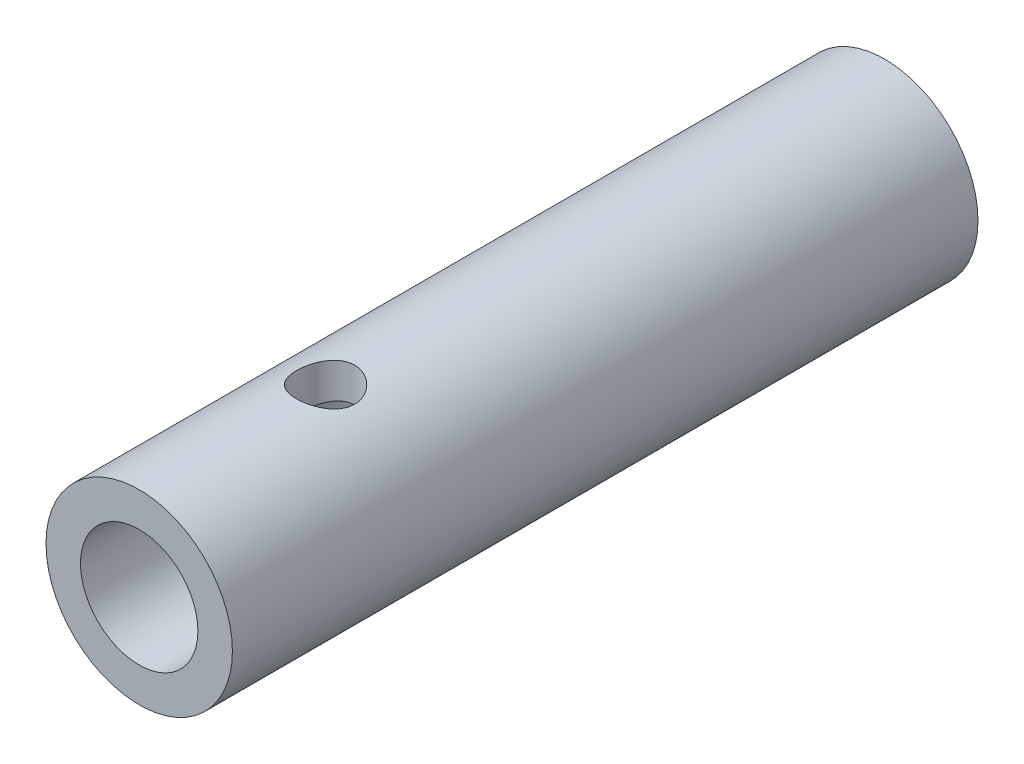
ISO-10303-21;
HEADER;
FILE_DESCRIPTION(('STEP AP214'),'2;1');
FILE_NAME('part.step','',(''),(''),'','','');
FILE_SCHEMA(('AUTOMOTIVE_DESIGN { 1 0 10303 214 1 1 1 1 }'));
ENDSEC;
DATA;
#1=APPLICATION_CONTEXT('core data for automotive mechanical design processes');
#2=APPLICATION_PROTOCOL_DEFINITION('international standard','automotive_design',2000,#1);
#3=PRODUCT_CONTEXT('',#1,'mechanical');
#4=PRODUCT('Part','Part','',(#3));
#5=PRODUCT_RELATED_PRODUCT_CATEGORY('part','',(#4));
#6=PRODUCT_DEFINITION_FORMATION('','',#4);
#7=PRODUCT_DEFINITION_CONTEXT('part definition',#1,'design');
#8=PRODUCT_DEFINITION('design','',#6,#7);
#9=PRODUCT_DEFINITION_SHAPE('','',#8);
#10=(LENGTH_UNIT() NAMED_UNIT(*) SI_UNIT(.MILLI.,.METRE.));
#11=(NAMED_UNIT(*) PLANE_ANGLE_UNIT() SI_UNIT($,.RADIAN.));
#12=(NAMED_UNIT(*) SI_UNIT($,.STERADIAN.) SOLID_ANGLE_UNIT());
#13=UNCERTAINTY_MEASURE_WITH_UNIT(LENGTH_MEASURE(1.E-05),#10,'distance_accuracy_value','');
#14=(GEOMETRIC_REPRESENTATION_CONTEXT(3) GLOBAL_UNCERTAINTY_ASSIGNED_CONTEXT((#13)) GLOBAL_UNIT_ASSIGNED_CONTEXT((#10,
#11,#12)) REPRESENTATION_CONTEXT('',''));
#15=CARTESIAN_POINT('',(0.,0.,0.));
#16=DIRECTION('',(0.,0.,1.));
#17=DIRECTION('',(1.,0.,0.));
#18=AXIS2_PLACEMENT_3D('',#15,#16,#17);
#19=CARTESIAN_POINT('',(0.,0.,12.7));
#20=DIRECTION('',(0.,0.,-1.));
#21=DIRECTION('',(-1.,0.,0.));
#22=AXIS2_PLACEMENT_3D('',#19,#20,#21);
#23=CYLINDRICAL_SURFACE('',#22,3.175);
#24=CARTESIAN_POINT('',(0.,0.,12.7));
#25=DIRECTION('',(0.,0.,1.));
#26=DIRECTION('',(1.,0.,0.));
#27=AXIS2_PLACEMENT_3D('',#24,#25,#26);
#28=CIRCLE('',#27,3.175);
#29=CARTESIAN_POINT('',(3.175,0.,12.7));
#30=VERTEX_POINT('',#29);
#31=EDGE_CURVE('E10',#30,#30,#28,.T.);
#32=ORIENTED_EDGE('',*,*,#31,.F.);
#33=EDGE_LOOP('',(#32));
#34=FACE_BOUND('',#33,.T.);
#35=CARTESIAN_POINT('',(0.,0.,-12.7));
#36=DIRECTION('',(0.,0.,1.));
#37=DIRECTION('',(1.,0.,0.));
#38=AXIS2_PLACEMENT_3D('',#35,#36,#37);
#39=CIRCLE('',#38,3.175);
#40=CARTESIAN_POINT('',(3.175,0.,-12.7));
#41=VERTEX_POINT('',#40);
#42=EDGE_CURVE('E44',#41,#41,#39,.T.);
#43=ORIENTED_EDGE('',*,*,#42,.T.);
#44=EDGE_LOOP('',(#43));
#45=FACE_BOUND('',#44,.T.);
#46=CARTESIAN_POINT('',(0.,3.175,5.3578125));
#47=CARTESIAN_POINT('',(-0.0543236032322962,3.17499972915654,5.35781285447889));
#48=CARTESIAN_POINT('',(-0.108650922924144,3.17359264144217,5.36228863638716));
#49=CARTESIAN_POINT('',(-0.215716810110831,3.1681173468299,5.38002657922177));
#50=CARTESIAN_POINT('',(-0.268455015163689,3.16404853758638,5.39329072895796));
#51=CARTESIAN_POINT('',(-0.370783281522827,3.15369428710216,5.42811443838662));
#52=CARTESIAN_POINT('',(-0.420378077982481,3.14741227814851,5.44966115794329));
#53=CARTESIAN_POINT('',(-0.515250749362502,3.13328025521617,5.50038374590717));
#54=CARTESIAN_POINT('',(-0.560527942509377,3.1254299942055,5.52956081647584));
#55=CARTESIAN_POINT('',(-0.646878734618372,3.10872357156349,5.59566444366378));
#56=CARTESIAN_POINT('',(-0.687800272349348,3.09984549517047,5.63278407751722));
#57=CARTESIAN_POINT('',(-0.762950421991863,3.08221099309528,5.71330803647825));
#58=CARTESIAN_POINT('',(-0.79717778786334,3.07345459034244,5.7567135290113));
#59=CARTESIAN_POINT('',(-0.858792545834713,3.05681971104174,5.84989349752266));
#60=CARTESIAN_POINT('',(-0.885989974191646,3.0489682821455,5.89979887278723));
#61=CARTESIAN_POINT('',(-0.93154294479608,3.03536192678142,6.00376015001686));
#62=CARTESIAN_POINT('',(-0.94990081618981,3.02960644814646,6.05781495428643));
#63=CARTESIAN_POINT('',(-0.97669715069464,3.02107288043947,6.16682478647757));
#64=CARTESIAN_POINT('',(-0.985417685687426,3.01821034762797,6.22170368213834));
#65=CARTESIAN_POINT('',(-0.993573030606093,3.01553606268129,6.33221453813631));
#66=CARTESIAN_POINT('',(-0.99301030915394,3.01572349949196,6.38784629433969));
#67=CARTESIAN_POINT('',(-0.982835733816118,3.01905343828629,6.49595035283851));
#68=CARTESIAN_POINT('',(-0.973582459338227,3.02207883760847,6.54846061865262));
#69=CARTESIAN_POINT('',(-0.946870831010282,3.03055357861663,6.65114252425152));
#70=CARTESIAN_POINT('',(-0.92941160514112,3.03600317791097,6.70131391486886));
#71=CARTESIAN_POINT('',(-0.886530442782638,3.04880203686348,6.7987481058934));
#72=CARTESIAN_POINT('',(-0.860995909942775,3.05617788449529,6.84595770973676));
#73=CARTESIAN_POINT('',(-0.80276716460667,3.0719859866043,6.93553966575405));
#74=CARTESIAN_POINT('',(-0.77007109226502,3.08041851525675,6.97791075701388));
#75=CARTESIAN_POINT('',(-0.696687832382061,3.09785962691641,7.05864011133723));
#76=CARTESIAN_POINT('',(-0.655704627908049,3.10687695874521,7.09672789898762));
#77=CARTESIAN_POINT('',(-0.567820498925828,3.12413309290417,7.16555581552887));
#78=CARTESIAN_POINT('',(-0.520919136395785,3.13237183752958,7.19629540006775));
#79=CARTESIAN_POINT('',(-0.422008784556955,3.14722902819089,7.24973760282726));
#80=CARTESIAN_POINT('',(-0.369962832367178,3.15383434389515,7.27237570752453));
#81=CARTESIAN_POINT('',(-0.262547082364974,3.16458564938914,7.30849519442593));
#82=CARTESIAN_POINT('',(-0.207178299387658,3.16873238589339,7.32197935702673));
#83=CARTESIAN_POINT('',(-0.0969844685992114,3.17397915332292,7.33894744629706));
#84=CARTESIAN_POINT('',(-0.0422210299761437,3.17519068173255,7.34279753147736));
#85=CARTESIAN_POINT('',(0.067175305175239,3.17476028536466,7.34142055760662));
#86=CARTESIAN_POINT('',(0.121808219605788,3.17311877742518,7.33619482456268));
#87=CARTESIAN_POINT('',(0.227980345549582,3.16724001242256,7.31710849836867));
#88=CARTESIAN_POINT('',(0.279562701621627,3.16306829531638,7.30346578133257));
#89=CARTESIAN_POINT('',(0.379691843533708,3.15261721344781,7.26819860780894));
#90=CARTESIAN_POINT('',(0.428238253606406,3.14633758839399,7.24657316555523));
#91=CARTESIAN_POINT('',(0.522233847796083,3.13212593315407,7.19536500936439));
#92=CARTESIAN_POINT('',(0.567578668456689,3.12415735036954,7.16560115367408));
#93=CARTESIAN_POINT('',(0.652752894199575,3.10747894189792,7.09917838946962));
#94=CARTESIAN_POINT('',(0.692580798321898,3.09876891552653,7.0625176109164));
#95=CARTESIAN_POINT('',(0.767228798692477,3.08115489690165,6.98161950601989));
#96=CARTESIAN_POINT('',(0.801787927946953,3.07225689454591,6.9371395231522));
#97=CARTESIAN_POINT('',(0.862974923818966,3.05563545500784,6.84281824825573));
#98=CARTESIAN_POINT('',(0.889602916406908,3.04791199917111,6.79297704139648));
#99=CARTESIAN_POINT('',(0.934006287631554,3.03459977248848,6.68945101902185));
#100=CARTESIAN_POINT('',(0.951815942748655,3.02900275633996,6.63578202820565));
#101=CARTESIAN_POINT('',(0.978081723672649,3.02062491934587,6.52599620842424));
#102=CARTESIAN_POINT('',(0.986541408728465,3.01784302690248,6.46988031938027));
#103=CARTESIAN_POINT('',(0.993611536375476,3.01552207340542,6.35952175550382));
#104=CARTESIAN_POINT('',(0.992650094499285,3.01584204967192,6.30530913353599));
#105=CARTESIAN_POINT('',(0.9819387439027,3.01934634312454,6.1978582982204));
#106=CARTESIAN_POINT('',(0.972189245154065,3.02253052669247,6.14462003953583));
#107=CARTESIAN_POINT('',(0.944465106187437,3.03130596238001,6.04139473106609));
#108=CARTESIAN_POINT('',(0.92661297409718,3.03686129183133,5.99137149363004));
#109=CARTESIAN_POINT('',(0.88328680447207,3.04974390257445,5.89499042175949));
#110=CARTESIAN_POINT('',(0.857811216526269,3.05707154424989,5.84863333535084));
#111=CARTESIAN_POINT('',(0.798795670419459,3.07303080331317,5.7589372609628));
#112=CARTESIAN_POINT('',(0.764979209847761,3.08170221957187,5.71578729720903));
#113=CARTESIAN_POINT('',(0.690728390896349,3.09918892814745,5.63563585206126));
#114=CARTESIAN_POINT('',(0.65029226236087,3.10800425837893,5.59863602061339));
#115=CARTESIAN_POINT('',(0.562361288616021,3.12513084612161,5.53062573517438));
#116=CARTESIAN_POINT('',(0.514679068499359,3.13341624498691,5.49985030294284));
#117=CARTESIAN_POINT('',(0.414559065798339,3.14822498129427,5.44679273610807));
#118=CARTESIAN_POINT('',(0.362123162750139,3.15474901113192,5.42450726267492));
#119=CARTESIAN_POINT('',(0.258562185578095,3.16484516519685,5.39068060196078));
#120=CARTESIAN_POINT('',(0.207700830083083,3.16862016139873,5.37839057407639));
#121=CARTESIAN_POINT('',(0.104560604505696,3.17369745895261,5.36195717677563));
#122=CARTESIAN_POINT('',(0.0522820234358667,3.17500026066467,5.35781215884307));
#123=CARTESIAN_POINT('',(0.,3.175,5.3578125));
#124=B_SPLINE_CURVE_WITH_KNOTS('',3,(#46,#47,#48,#49,#50,#51,#52,#53,#54,#55,#56,#57,#58,#59,
#60,#61,#62,#63,#64,#65,#66,#67,#68,#69,#70,#71,#72,#73,#74,#75,#76,#77,#78,#79,#80,#81,#82,#83,
#84,#85,#86,#87,#88,#89,#90,#91,#92,#93,#94,#95,#96,#97,#98,#99,#100,#101,#102,#103,#104,#105,
#106,#107,#108,#109,#110,#111,#112,#113,#114,#115,#116,#117,#118,#119,#120,#121,#122,#123),
.UNSPECIFIED.,.T.,.F.,(4,2,2,2,2,2,2,2,2,2,2,2,2,2,2,2,2,2,2,2,2,2,2,2,2,2,2,2,2,2,2,2,2,2,2,2,
2,2,4),(0.,0.162778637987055,0.325594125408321,0.488158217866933,0.650747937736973,
0.817862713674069,0.985008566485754,1.15628555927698,1.32751739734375,1.49359262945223,
1.65962369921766,1.81909178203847,1.97857681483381,2.14039166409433,2.30224858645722,
2.47147355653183,2.64071105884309,2.81126771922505,2.98177255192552,3.14569132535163,
3.30958615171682,3.4694068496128,3.62924728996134,3.7929845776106,3.95676632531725,
4.12703786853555,4.29730670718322,4.46690841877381,4.63644554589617,4.79831561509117,
4.96017813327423,5.11967093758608,5.27919620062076,5.4449623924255,5.61077298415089,
5.7819978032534,5.95315521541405,6.10984805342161,6.26650917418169),.UNSPECIFIED.);
#125=CARTESIAN_POINT('',(0.,3.175,5.3578125));
#126=VERTEX_POINT('',#125);
#127=EDGE_CURVE('E54',#126,#126,#124,.T.);
#128=ORIENTED_EDGE('',*,*,#127,.F.);
#129=EDGE_LOOP('',(#128));
#130=FACE_BOUND('',#129,.T.);
#131=ADVANCED_FACE('F31',(#34,#45,#130),#23,.T.);
#132=CARTESIAN_POINT('',(0.,0.,3.175));
#133=DIRECTION('',(0.,0.,1.));
#134=DIRECTION('',(1.,0.,0.));
#135=AXIS2_PLACEMENT_3D('',#132,#133,#134);
#136=CYLINDRICAL_SURFACE('',#135,2.);
#137=CARTESIAN_POINT('',(0.,0.,3.175));
#138=DIRECTION('',(0.,0.,1.));
#139=DIRECTION('',(1.,0.,0.));
#140=AXIS2_PLACEMENT_3D('',#137,#138,#139);
#141=CIRCLE('',#140,2.);
#142=CARTESIAN_POINT('',(2.,0.,3.175));
#143=VERTEX_POINT('',#142);
#144=EDGE_CURVE('E49',#143,#143,#141,.T.);
#145=ORIENTED_EDGE('',*,*,#144,.F.);
#146=EDGE_LOOP('',(#145));
#147=FACE_BOUND('',#146,.T.);
#148=CARTESIAN_POINT('',(0.,0.,12.7));
#149=DIRECTION('',(0.,0.,1.));
#150=DIRECTION('',(1.,0.,0.));
#151=AXIS2_PLACEMENT_3D('',#148,#149,#150);
#152=CIRCLE('',#151,2.);
#153=CARTESIAN_POINT('',(2.,0.,12.7));
#154=VERTEX_POINT('',#153);
#155=EDGE_CURVE('E51',#154,#154,#152,.T.);
#156=ORIENTED_EDGE('',*,*,#155,.T.);
#157=EDGE_LOOP('',(#156));
#158=FACE_BOUND('',#157,.T.);
#159=CARTESIAN_POINT('',(0.,2.,5.3578125));
#160=CARTESIAN_POINT('',(0.0522099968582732,1.9999971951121,5.35781574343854));
#161=CARTESIAN_POINT('',(0.104483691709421,1.99793358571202,5.36195774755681));
#162=CARTESIAN_POINT('',(0.207489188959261,1.98988197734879,5.37834403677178));
#163=CARTESIAN_POINT('',(0.258217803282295,1.98388637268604,5.39060402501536));
#164=CARTESIAN_POINT('',(0.356485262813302,1.9685989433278,5.42263040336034));
#165=CARTESIAN_POINT('',(0.404035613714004,1.95931987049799,5.44236777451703));
#166=CARTESIAN_POINT('',(0.495080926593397,1.93831908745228,5.48863997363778));
#167=CARTESIAN_POINT('',(0.538576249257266,1.92659759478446,5.51517419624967));
#168=CARTESIAN_POINT('',(0.623204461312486,1.90096980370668,5.57609371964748));
#169=CARTESIAN_POINT('',(0.664040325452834,1.88697474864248,5.61085375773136));
#170=CARTESIAN_POINT('',(0.739575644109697,1.85867101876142,5.68643231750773));
#171=CARTESIAN_POINT('',(0.774270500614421,1.84436211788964,5.72725533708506));
#172=CARTESIAN_POINT('',(0.839182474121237,1.81579857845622,5.81752606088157));
#173=CARTESIAN_POINT('',(0.868858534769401,1.80163079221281,5.86739353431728));
#174=CARTESIAN_POINT('',(0.919277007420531,1.77643730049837,5.97219061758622));
#175=CARTESIAN_POINT('',(0.940025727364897,1.76540937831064,6.0271166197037));
#176=CARTESIAN_POINT('',(0.970663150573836,1.74874324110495,6.1371365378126));
#177=CARTESIAN_POINT('',(0.98112419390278,1.74282356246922,6.19202631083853));
#178=CARTESIAN_POINT('',(0.99264392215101,1.73629118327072,6.30307474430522));
#179=CARTESIAN_POINT('',(0.993711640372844,1.73567338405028,6.35923213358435));
#180=CARTESIAN_POINT('',(0.986834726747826,1.73958747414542,6.46414377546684));
#181=CARTESIAN_POINT('',(0.979932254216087,1.74352397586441,6.51299392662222));
#182=CARTESIAN_POINT('',(0.959113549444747,1.7550616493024,6.60872341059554));
#183=CARTESIAN_POINT('',(0.945195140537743,1.76266395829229,6.65560212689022));
#184=CARTESIAN_POINT('',(0.910482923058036,1.780845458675,6.74739462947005));
#185=CARTESIAN_POINT('',(0.88953638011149,1.79148992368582,6.79223712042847));
#186=CARTESIAN_POINT('',(0.841478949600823,1.81455859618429,6.87798454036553));
#187=CARTESIAN_POINT('',(0.8143652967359,1.82698360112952,6.91888769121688));
#188=CARTESIAN_POINT('',(0.750803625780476,1.85408446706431,7.00095953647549));
#189=CARTESIAN_POINT('',(0.713613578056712,1.86884791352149,7.04152663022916));
#190=CARTESIAN_POINT('',(0.632892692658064,1.89770500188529,7.11609643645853));
#191=CARTESIAN_POINT('',(0.589358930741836,1.9117983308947,7.15009610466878));
#192=CARTESIAN_POINT('',(0.494697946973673,1.93850361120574,7.21200220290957));
#193=CARTESIAN_POINT('',(0.443316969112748,1.95102020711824,7.2395650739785));
#194=CARTESIAN_POINT('',(0.335868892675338,1.97235454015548,7.28543178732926));
#195=CARTESIAN_POINT('',(0.279805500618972,1.98117517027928,7.30374287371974));
#196=CARTESIAN_POINT('',(0.169511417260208,1.99351179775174,7.32910002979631));
#197=CARTESIAN_POINT('',(0.115507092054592,1.99740329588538,7.33694634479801));
#198=CARTESIAN_POINT('',(0.00681592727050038,2.00072590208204,7.34365488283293));
#199=CARTESIAN_POINT('',(-0.0478705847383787,2.00015907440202,7.34252126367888));
#200=CARTESIAN_POINT('',(-0.151954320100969,1.99484856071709,7.33177118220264));
#201=CARTESIAN_POINT('',(-0.201437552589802,1.99042574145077,7.32280627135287));
#202=CARTESIAN_POINT('',(-0.29809991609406,1.97825947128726,7.29766410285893));
#203=CARTESIAN_POINT('',(-0.345278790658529,1.97051565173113,7.28148604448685));
#204=CARTESIAN_POINT('',(-0.437570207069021,1.95213005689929,7.24194306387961));
#205=CARTESIAN_POINT('',(-0.482583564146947,1.94141096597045,7.21838387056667));
#206=CARTESIAN_POINT('',(-0.568168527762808,1.91811232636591,7.16496522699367));
#207=CARTESIAN_POINT('',(-0.608738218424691,1.90553198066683,7.13510307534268));
#208=CARTESIAN_POINT('',(-0.688456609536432,1.87828893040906,7.06658042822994));
#209=CARTESIAN_POINT('',(-0.727085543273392,1.86354261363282,7.02734739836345));
#210=CARTESIAN_POINT('',(-0.797441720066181,1.8345402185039,6.94291271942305));
#211=CARTESIAN_POINT('',(-0.829164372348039,1.82028447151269,6.89770713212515));
#212=CARTESIAN_POINT('',(-0.886186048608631,1.79324222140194,6.79995185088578));
#213=CARTESIAN_POINT('',(-0.911118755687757,1.78055457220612,6.74715872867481));
#214=CARTESIAN_POINT('',(-0.951478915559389,1.75932253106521,6.63729293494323));
#215=CARTESIAN_POINT('',(-0.966918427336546,1.75077288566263,6.58022579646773));
#216=CARTESIAN_POINT('',(-0.98644589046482,1.73983864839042,6.46926497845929));
#217=CARTESIAN_POINT('',(-0.991476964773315,1.73694334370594,6.4155885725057));
#218=CARTESIAN_POINT('',(-0.99275656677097,1.73621333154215,6.30810606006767));
#219=CARTESIAN_POINT('',(-0.989008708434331,1.73837654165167,6.25430001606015));
#220=CARTESIAN_POINT('',(-0.973715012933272,1.74698104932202,6.15332490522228));
#221=CARTESIAN_POINT('',(-0.962922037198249,1.75300840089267,6.1060020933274));
#222=CARTESIAN_POINT('',(-0.934764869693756,1.76818236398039,6.01388710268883));
#223=CARTESIAN_POINT('',(-0.917398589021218,1.77732996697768,5.96909573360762));
#224=CARTESIAN_POINT('',(-0.875278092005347,1.79846537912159,5.87998424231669));
#225=CARTESIAN_POINT('',(-0.850105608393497,1.81060281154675,5.83589834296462));
#226=CARTESIAN_POINT('',(-0.793554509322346,1.8360917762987,5.752289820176));
#227=CARTESIAN_POINT('',(-0.762172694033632,1.84944393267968,5.71276956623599));
#228=CARTESIAN_POINT('',(-0.689715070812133,1.87775883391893,5.63452882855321));
#229=CARTESIAN_POINT('',(-0.647930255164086,1.89272428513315,5.59646234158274));
#230=CARTESIAN_POINT('',(-0.558139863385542,1.92111824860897,5.5277397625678));
#231=CARTESIAN_POINT('',(-0.510131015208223,1.93454594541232,5.49708759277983));
#232=CARTESIAN_POINT('',(-0.408698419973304,1.95849303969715,5.4440785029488));
#233=CARTESIAN_POINT('',(-0.355246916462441,1.96899639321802,5.42176712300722));
#234=CARTESIAN_POINT('',(-0.244744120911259,1.9857489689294,5.38673743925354));
#235=CARTESIAN_POINT('',(-0.187703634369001,1.99201035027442,5.37399170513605));
#236=CARTESIAN_POINT('',(-0.108408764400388,1.99717748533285,5.36351252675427));
#237=CARTESIAN_POINT('',(-0.0867997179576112,1.99823325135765,5.36137794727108));
#238=CARTESIAN_POINT('',(-0.0434641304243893,1.99964510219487,5.35852723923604));
#239=CARTESIAN_POINT('',(-0.0217375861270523,2.0000011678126,5.35781114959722));
#240=CARTESIAN_POINT('',(0.,2.,5.3578125));
#241=B_SPLINE_CURVE_WITH_KNOTS('',3,(#159,#160,#161,#162,#163,#164,#165,#166,#167,#168,#169,
#170,#171,#172,#173,#174,#175,#176,#177,#178,#179,#180,#181,#182,#183,#184,#185,#186,#187,#188,
#189,#190,#191,#192,#193,#194,#195,#196,#197,#198,#199,#200,#201,#202,#203,#204,#205,#206,#207,
#208,#209,#210,#211,#212,#213,#214,#215,#216,#217,#218,#219,#220,#221,#222,#223,#224,#225,#226,
#227,#228,#229,#230,#231,#232,#233,#234,#235,#236,#237,#238,#239,#240),.UNSPECIFIED.,.T.,.F.,(4,
2,2,2,2,2,2,2,2,2,2,2,2,2,2,2,2,2,2,2,2,2,2,2,2,2,2,2,2,2,2,2,2,2,2,2,2,2,2,2,4),(0.,
0.156541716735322,0.313387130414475,0.469629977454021,0.625858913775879,0.791434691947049,
0.95713392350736,1.13543225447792,1.3136043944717,1.4811832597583,1.64860095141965,
1.7963862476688,1.94421742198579,2.09549528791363,2.24684112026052,2.41703945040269,
2.58731648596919,2.76526554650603,2.94307505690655,3.10631198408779,3.26947333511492,
3.4202286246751,3.57100065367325,3.72613199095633,3.88132995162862,4.05158562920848,
4.22195413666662,4.40022706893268,4.57827307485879,4.73931862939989,4.90029789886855,
5.04639642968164,5.19254142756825,5.34851377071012,5.50456670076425,5.67917735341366,
5.85388017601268,6.02952339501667,6.204660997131,6.26983521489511,6.33501122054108),.UNSPECIFIED.);
#242=CARTESIAN_POINT('',(0.,2.,5.3578125));
#243=VERTEX_POINT('',#242);
#244=EDGE_CURVE('E35',#243,#243,#241,.T.);
#245=ORIENTED_EDGE('',*,*,#244,.F.);
#246=EDGE_LOOP('',(#245));
#247=FACE_BOUND('',#246,.T.);
#248=ADVANCED_FACE('F71',(#147,#158,#247),#136,.F.);
#249=CARTESIAN_POINT('',(0.,0.,12.7));
#250=DIRECTION('',(0.,0.,1.));
#251=DIRECTION('',(1.,0.,0.));
#252=AXIS2_PLACEMENT_3D('',#249,#250,#251);
#253=PLANE('',#252);
#254=ORIENTED_EDGE('',*,*,#155,.F.);
#255=EDGE_LOOP('',(#254));
#256=FACE_BOUND('',#255,.T.);
#257=ORIENTED_EDGE('',*,*,#31,.T.);
#258=EDGE_LOOP('',(#257));
#259=FACE_BOUND('',#258,.T.);
#260=ADVANCED_FACE('F75',(#256,#259),#253,.T.);
#261=CARTESIAN_POINT('',(0.,0.,-12.7));
#262=DIRECTION('',(0.,0.,1.));
#263=DIRECTION('',(1.,0.,0.));
#264=AXIS2_PLACEMENT_3D('',#261,#262,#263);
#265=PLANE('',#264);
#266=ORIENTED_EDGE('',*,*,#42,.F.);
#267=EDGE_LOOP('',(#266));
#268=FACE_BOUND('',#267,.T.);
#269=ADVANCED_FACE('F69',(#268),#265,.F.);
#270=CARTESIAN_POINT('',(0.,0.,3.175));
#271=DIRECTION('',(0.,0.,1.));
#272=DIRECTION('',(1.,0.,0.));
#273=AXIS2_PLACEMENT_3D('',#270,#271,#272);
#274=PLANE('',#273);
#275=ORIENTED_EDGE('',*,*,#144,.T.);
#276=EDGE_LOOP('',(#275));
#277=FACE_BOUND('',#276,.T.);
#278=ADVANCED_FACE('F65',(#277),#274,.T.);
#279=CARTESIAN_POINT('',(0.,9.525,6.35));
#280=DIRECTION('',(0.,-1.,0.));
#281=DIRECTION('',(0.,0.,-1.));
#282=AXIS2_PLACEMENT_3D('',#279,#280,#281);
#283=CYLINDRICAL_SURFACE('',#282,0.9921875);
#284=ORIENTED_EDGE('',*,*,#244,.T.);
#285=EDGE_LOOP('',(#284));
#286=FACE_BOUND('',#285,.T.);
#287=ORIENTED_EDGE('',*,*,#127,.T.);
#288=EDGE_LOOP('',(#287));
#289=FACE_BOUND('',#288,.T.);
#290=ADVANCED_FACE('F61',(#286,#289),#283,.F.);
#291=CLOSED_SHELL('',(#131,#248,#260,#269,#278,#290));
#292=MANIFOLD_SOLID_BREP('B2',#291);
#293=ADVANCED_BREP_SHAPE_REPRESENTATION('',(#18,#292),#14);
#294=SHAPE_DEFINITION_REPRESENTATION(#9,#293);
ENDSEC;
END-ISO-10303-21;
